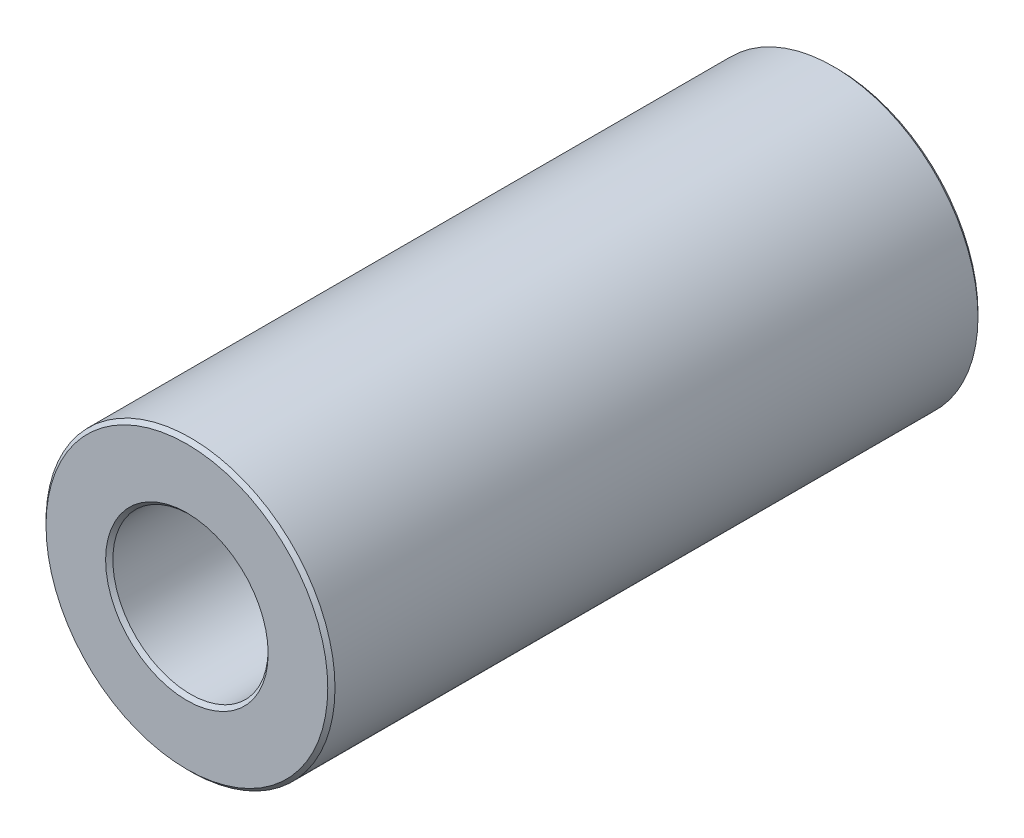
from build123d import *

# Parameters (mm, degrees)
SKETCH1_R           = 4
SKETCH1_R_2         = 2.15
BOSS_EXTRUDE2_DEPTH = 9
CHAMFER3_SIZE       = 0.1


with BuildPart() as part:
    # Sketch1 → Boss-Extrude2 (new, symmetric)
    with BuildSketch(Plane.XY):
        Circle(SKETCH1_R)
        Circle(SKETCH1_R_2, mode=Mode.SUBTRACT)
    extrude(amount=BOSS_EXTRUDE2_DEPTH, both=True)

    # Chamfer3
    chamfer3_edges = [part.edges().sort_by_distance(p)[0] for p in [
        (-4, 0, -9),
        (-4, 0, 9),
        (-2.15, 0, -9),
        (-2.15, 0, 9),
    ]]
    chamfer(chamfer3_edges, length=CHAMFER3_SIZE)


solid = part.part
